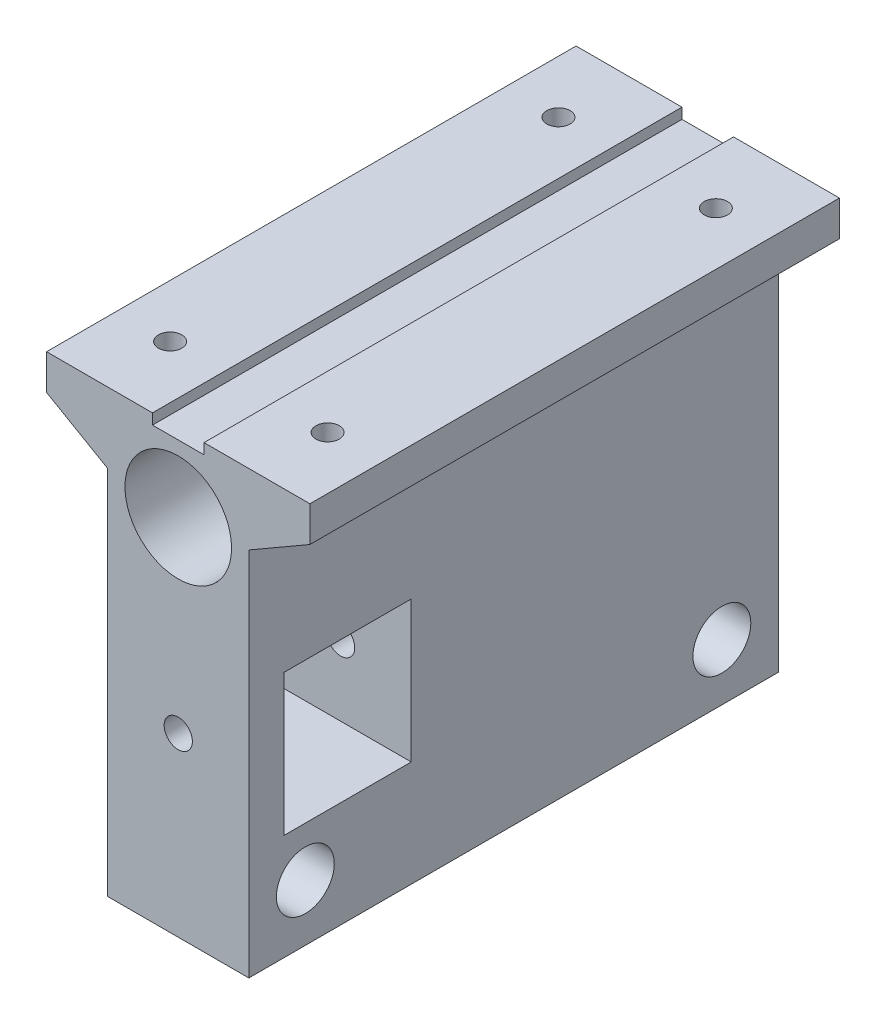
ISO-10303-21;
HEADER;
FILE_DESCRIPTION(('STEP AP214'),'2;1');
FILE_NAME('part.step','',(''),(''),'','','');
FILE_SCHEMA(('AUTOMOTIVE_DESIGN { 1 0 10303 214 1 1 1 1 }'));
ENDSEC;
DATA;
#1=APPLICATION_CONTEXT('core data for automotive mechanical design processes');
#2=APPLICATION_PROTOCOL_DEFINITION('international standard','automotive_design',2000,#1);
#3=PRODUCT_CONTEXT('',#1,'mechanical');
#4=PRODUCT('Part','Part','',(#3));
#5=PRODUCT_RELATED_PRODUCT_CATEGORY('part','',(#4));
#6=PRODUCT_DEFINITION_FORMATION('','',#4);
#7=PRODUCT_DEFINITION_CONTEXT('part definition',#1,'design');
#8=PRODUCT_DEFINITION('design','',#6,#7);
#9=PRODUCT_DEFINITION_SHAPE('','',#8);
#10=(LENGTH_UNIT() NAMED_UNIT(*) SI_UNIT(.MILLI.,.METRE.));
#11=(NAMED_UNIT(*) PLANE_ANGLE_UNIT() SI_UNIT($,.RADIAN.));
#12=(NAMED_UNIT(*) SI_UNIT($,.STERADIAN.) SOLID_ANGLE_UNIT());
#13=UNCERTAINTY_MEASURE_WITH_UNIT(LENGTH_MEASURE(1.E-05),#10,'distance_accuracy_value','');
#14=(GEOMETRIC_REPRESENTATION_CONTEXT(3) GLOBAL_UNCERTAINTY_ASSIGNED_CONTEXT((#13)) GLOBAL_UNIT_ASSIGNED_CONTEXT((#10,
#11,#12)) REPRESENTATION_CONTEXT('',''));
#15=CARTESIAN_POINT('',(0.,0.,0.));
#16=DIRECTION('',(0.,0.,1.));
#17=DIRECTION('',(1.,0.,0.));
#18=AXIS2_PLACEMENT_3D('',#15,#16,#17);
#19=CARTESIAN_POINT('',(-10.,1.00592017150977,75.));
#20=DIRECTION('',(1.,0.,0.));
#21=DIRECTION('',(0.,1.,0.));
#22=AXIS2_PLACEMENT_3D('',#19,#20,#21);
#23=PLANE('',#22);
#24=DIRECTION('',(0.,-1.,0.));
#25=VECTOR('',#24,1.);
#26=CARTESIAN_POINT('',(-10.,1.00592017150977,0.));
#27=LINE('',#26,#25);
#28=CARTESIAN_POINT('',(-10.,1.00592017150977,0.));
#29=VERTEX_POINT('',#28);
#30=CARTESIAN_POINT('',(-10.,-51.5,0.));
#31=VERTEX_POINT('',#30);
#32=EDGE_CURVE('E247',#29,#31,#27,.T.);
#33=ORIENTED_EDGE('',*,*,#32,.T.);
#34=DIRECTION('',(0.,0.,-1.));
#35=VECTOR('',#34,1.);
#36=CARTESIAN_POINT('',(-10.,-51.5,75.));
#37=LINE('',#36,#35);
#38=CARTESIAN_POINT('',(-10.,-51.5,75.));
#39=VERTEX_POINT('',#38);
#40=EDGE_CURVE('E287',#39,#31,#37,.T.);
#41=ORIENTED_EDGE('',*,*,#40,.F.);
#42=DIRECTION('',(0.,-1.,0.));
#43=VECTOR('',#42,1.);
#44=CARTESIAN_POINT('',(-10.,1.00592017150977,75.));
#45=LINE('',#44,#43);
#46=CARTESIAN_POINT('',(-10.,1.00592017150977,75.));
#47=VERTEX_POINT('',#46);
#48=EDGE_CURVE('E222',#47,#39,#45,.T.);
#49=ORIENTED_EDGE('',*,*,#48,.F.);
#50=DIRECTION('',(0.,0.,-1.));
#51=VECTOR('',#50,1.);
#52=CARTESIAN_POINT('',(-10.,1.00592017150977,75.));
#53=LINE('',#52,#51);
#54=EDGE_CURVE('E290',#47,#29,#53,.T.);
#55=ORIENTED_EDGE('',*,*,#54,.T.);
#56=EDGE_LOOP('',(#33,#41,#49,#55));
#57=FACE_BOUND('',#56,.T.);
#58=DIRECTION('',(0.,0.,-1.));
#59=VECTOR('',#58,1.);
#60=CARTESIAN_POINT('',(-10.,-16.5,75.));
#61=LINE('',#60,#59);
#62=CARTESIAN_POINT('',(-10.,-16.5,70.));
#63=VERTEX_POINT('',#62);
#64=CARTESIAN_POINT('',(-10.,-16.5,52.));
#65=VERTEX_POINT('',#64);
#66=EDGE_CURVE('E157',#63,#65,#61,.T.);
#67=ORIENTED_EDGE('',*,*,#66,.F.);
#68=DIRECTION('',(0.,-1.,0.));
#69=VECTOR('',#68,1.);
#70=CARTESIAN_POINT('',(-10.,1.00592017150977,70.));
#71=LINE('',#70,#69);
#72=CARTESIAN_POINT('',(-10.,-36.5,70.));
#73=VERTEX_POINT('',#72);
#74=EDGE_CURVE('E160',#63,#73,#71,.T.);
#75=ORIENTED_EDGE('',*,*,#74,.T.);
#76=DIRECTION('',(0.,0.,-1.));
#77=VECTOR('',#76,1.);
#78=CARTESIAN_POINT('',(-10.,-36.5,75.));
#79=LINE('',#78,#77);
#80=CARTESIAN_POINT('',(-10.,-36.5,52.));
#81=VERTEX_POINT('',#80);
#82=EDGE_CURVE('E189',#73,#81,#79,.T.);
#83=ORIENTED_EDGE('',*,*,#82,.T.);
#84=DIRECTION('',(0.,-1.,0.));
#85=VECTOR('',#84,1.);
#86=CARTESIAN_POINT('',(-10.,1.00592017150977,52.));
#87=LINE('',#86,#85);
#88=EDGE_CURVE('E192',#65,#81,#87,.T.);
#89=ORIENTED_EDGE('',*,*,#88,.F.);
#90=EDGE_LOOP('',(#67,#75,#83,#89));
#91=FACE_BOUND('',#90,.T.);
#92=ADVANCED_FACE('F40',(#57,#91),#23,.F.);
#93=CARTESIAN_POINT('',(10.,1.00592017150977,75.));
#94=DIRECTION('',(-1.,0.,0.));
#95=DIRECTION('',(0.,-1.,0.));
#96=AXIS2_PLACEMENT_3D('',#93,#94,#95);
#97=PLANE('',#96);
#98=DIRECTION('',(0.,1.,0.));
#99=VECTOR('',#98,1.);
#100=CARTESIAN_POINT('',(10.,1.00592017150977,0.));
#101=LINE('',#100,#99);
#102=CARTESIAN_POINT('',(10.,-51.5,0.));
#103=VERTEX_POINT('',#102);
#104=CARTESIAN_POINT('',(10.,1.00592017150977,0.));
#105=VERTEX_POINT('',#104);
#106=EDGE_CURVE('E251',#103,#105,#101,.T.);
#107=ORIENTED_EDGE('',*,*,#106,.T.);
#108=DIRECTION('',(0.,0.,-1.));
#109=VECTOR('',#108,1.);
#110=CARTESIAN_POINT('',(10.,1.00592017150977,75.));
#111=LINE('',#110,#109);
#112=CARTESIAN_POINT('',(10.,1.00592017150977,75.));
#113=VERTEX_POINT('',#112);
#114=EDGE_CURVE('E281',#113,#105,#111,.T.);
#115=ORIENTED_EDGE('',*,*,#114,.F.);
#116=DIRECTION('',(0.,1.,0.));
#117=VECTOR('',#116,1.);
#118=CARTESIAN_POINT('',(10.,1.00592017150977,75.));
#119=LINE('',#118,#117);
#120=CARTESIAN_POINT('',(10.,-51.5,75.));
#121=VERTEX_POINT('',#120);
#122=EDGE_CURVE('E226',#121,#113,#119,.T.);
#123=ORIENTED_EDGE('',*,*,#122,.F.);
#124=DIRECTION('',(0.,0.,-1.));
#125=VECTOR('',#124,1.);
#126=CARTESIAN_POINT('',(10.,-51.5,75.));
#127=LINE('',#126,#125);
#128=EDGE_CURVE('E284',#121,#103,#127,.T.);
#129=ORIENTED_EDGE('',*,*,#128,.T.);
#130=EDGE_LOOP('',(#107,#115,#123,#129));
#131=FACE_BOUND('',#130,.T.);
#132=CARTESIAN_POINT('',(10.,-43.5,67.));
#133=DIRECTION('',(1.,0.,0.));
#134=DIRECTION('',(0.,1.,0.));
#135=AXIS2_PLACEMENT_3D('',#132,#133,#134);
#136=CIRCLE('',#135,4.1);
#137=CARTESIAN_POINT('',(10.,-39.4,67.));
#138=VERTEX_POINT('',#137);
#139=EDGE_CURVE('E195',#138,#138,#136,.T.);
#140=ORIENTED_EDGE('',*,*,#139,.F.);
#141=EDGE_LOOP('',(#140));
#142=FACE_BOUND('',#141,.T.);
#143=CARTESIAN_POINT('',(10.,-43.5,8.));
#144=DIRECTION('',(1.,0.,0.));
#145=DIRECTION('',(0.,1.,0.));
#146=AXIS2_PLACEMENT_3D('',#143,#144,#145);
#147=CIRCLE('',#146,4.1);
#148=CARTESIAN_POINT('',(10.,-39.4,8.));
#149=VERTEX_POINT('',#148);
#150=EDGE_CURVE('E200',#149,#149,#147,.T.);
#151=ORIENTED_EDGE('',*,*,#150,.F.);
#152=EDGE_LOOP('',(#151));
#153=FACE_BOUND('',#152,.T.);
#154=DIRECTION('',(0.,0.,-1.));
#155=VECTOR('',#154,1.);
#156=CARTESIAN_POINT('',(10.,-16.5,70.));
#157=LINE('',#156,#155);
#158=CARTESIAN_POINT('',(10.,-16.5,70.));
#159=VERTEX_POINT('',#158);
#160=CARTESIAN_POINT('',(10.,-16.5,52.));
#161=VERTEX_POINT('',#160);
#162=EDGE_CURVE('E64',#159,#161,#157,.T.);
#163=ORIENTED_EDGE('',*,*,#162,.T.);
#164=DIRECTION('',(0.,-1.,0.));
#165=VECTOR('',#164,1.);
#166=CARTESIAN_POINT('',(10.,-16.5,52.));
#167=LINE('',#166,#165);
#168=CARTESIAN_POINT('',(10.,-36.5,52.));
#169=VERTEX_POINT('',#168);
#170=EDGE_CURVE('E164',#161,#169,#167,.T.);
#171=ORIENTED_EDGE('',*,*,#170,.T.);
#172=DIRECTION('',(0.,0.,-1.));
#173=VECTOR('',#172,1.);
#174=CARTESIAN_POINT('',(10.,-36.5,70.));
#175=LINE('',#174,#173);
#176=CARTESIAN_POINT('',(10.,-36.5,70.));
#177=VERTEX_POINT('',#176);
#178=EDGE_CURVE('E170',#177,#169,#175,.T.);
#179=ORIENTED_EDGE('',*,*,#178,.F.);
#180=DIRECTION('',(0.,-1.,0.));
#181=VECTOR('',#180,1.);
#182=CARTESIAN_POINT('',(10.,-16.5,70.));
#183=LINE('',#182,#181);
#184=EDGE_CURVE('E174',#159,#177,#183,.T.);
#185=ORIENTED_EDGE('',*,*,#184,.F.);
#186=EDGE_LOOP('',(#163,#171,#179,#185));
#187=FACE_BOUND('',#186,.T.);
#188=ADVANCED_FACE('F173',(#131,#142,#153,#187),#97,.F.);
#189=CARTESIAN_POINT('',(0.,0.,75.));
#190=DIRECTION('',(0.,0.,1.));
#191=DIRECTION('',(1.,0.,0.));
#192=AXIS2_PLACEMENT_3D('',#189,#190,#191);
#193=PLANE('',#192);
#194=CARTESIAN_POINT('',(0.,-26.5,75.));
#195=DIRECTION('',(0.,0.,1.));
#196=DIRECTION('',(1.,0.,0.));
#197=AXIS2_PLACEMENT_3D('',#194,#195,#196);
#198=CIRCLE('',#197,2.);
#199=CARTESIAN_POINT('',(2.,-26.5,75.));
#200=VERTEX_POINT('',#199);
#201=EDGE_CURVE('E407',#200,#200,#198,.T.);
#202=ORIENTED_EDGE('',*,*,#201,.F.);
#203=EDGE_LOOP('',(#202));
#204=FACE_BOUND('',#203,.T.);
#205=DIRECTION('',(-1.,0.,0.));
#206=VECTOR('',#205,1.);
#207=CARTESIAN_POINT('',(-3.65,11.,75.));
#208=LINE('',#207,#206);
#209=CARTESIAN_POINT('',(-3.65,11.,75.));
#210=VERTEX_POINT('',#209);
#211=CARTESIAN_POINT('',(-18.65,11.,75.));
#212=VERTEX_POINT('',#211);
#213=EDGE_CURVE('E214',#210,#212,#208,.T.);
#214=ORIENTED_EDGE('',*,*,#213,.T.);
#215=DIRECTION('',(0.,-1.,0.));
#216=VECTOR('',#215,1.);
#217=CARTESIAN_POINT('',(-18.65,11.,75.));
#218=LINE('',#217,#216);
#219=CARTESIAN_POINT('',(-18.65,6.,75.));
#220=VERTEX_POINT('',#219);
#221=EDGE_CURVE('E217',#212,#220,#218,.T.);
#222=ORIENTED_EDGE('',*,*,#221,.T.);
#223=DIRECTION('',(0.86602540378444,-0.499999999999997,0.));
#224=VECTOR('',#223,1.);
#225=CARTESIAN_POINT('',(-18.65,6.,75.));
#226=LINE('',#225,#224);
#227=EDGE_CURVE('E220',#220,#47,#226,.T.);
#228=ORIENTED_EDGE('',*,*,#227,.T.);
#229=ORIENTED_EDGE('',*,*,#48,.T.);
#230=DIRECTION('',(1.,0.,0.));
#231=VECTOR('',#230,1.);
#232=CARTESIAN_POINT('',(-10.,-51.5,75.));
#233=LINE('',#232,#231);
#234=EDGE_CURVE('E224',#39,#121,#233,.T.);
#235=ORIENTED_EDGE('',*,*,#234,.T.);
#236=ORIENTED_EDGE('',*,*,#122,.T.);
#237=DIRECTION('',(0.86602540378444,0.499999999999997,0.));
#238=VECTOR('',#237,1.);
#239=CARTESIAN_POINT('',(18.65,5.99999999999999,75.));
#240=LINE('',#239,#238);
#241=CARTESIAN_POINT('',(18.65,5.99999999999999,75.));
#242=VERTEX_POINT('',#241);
#243=EDGE_CURVE('E228',#113,#242,#240,.T.);
#244=ORIENTED_EDGE('',*,*,#243,.T.);
#245=DIRECTION('',(0.,1.,0.));
#246=VECTOR('',#245,1.);
#247=CARTESIAN_POINT('',(18.65,11.,75.));
#248=LINE('',#247,#246);
#249=CARTESIAN_POINT('',(18.65,11.,75.));
#250=VERTEX_POINT('',#249);
#251=EDGE_CURVE('E230',#242,#250,#248,.T.);
#252=ORIENTED_EDGE('',*,*,#251,.T.);
#253=DIRECTION('',(-1.,0.,0.));
#254=VECTOR('',#253,1.);
#255=CARTESIAN_POINT('',(3.65,11.,75.));
#256=LINE('',#255,#254);
#257=CARTESIAN_POINT('',(3.65,11.,75.));
#258=VERTEX_POINT('',#257);
#259=EDGE_CURVE('E232',#250,#258,#256,.T.);
#260=ORIENTED_EDGE('',*,*,#259,.T.);
#261=DIRECTION('',(0.,-1.,0.));
#262=VECTOR('',#261,1.);
#263=CARTESIAN_POINT('',(3.65,9.5,75.));
#264=LINE('',#263,#262);
#265=CARTESIAN_POINT('',(3.65,9.5,75.));
#266=VERTEX_POINT('',#265);
#267=EDGE_CURVE('E234',#258,#266,#264,.T.);
#268=ORIENTED_EDGE('',*,*,#267,.T.);
#269=DIRECTION('',(-1.,0.,0.));
#270=VECTOR('',#269,1.);
#271=CARTESIAN_POINT('',(-3.65,9.5,75.));
#272=LINE('',#271,#270);
#273=CARTESIAN_POINT('',(-3.65,9.5,75.));
#274=VERTEX_POINT('',#273);
#275=EDGE_CURVE('E236',#266,#274,#272,.T.);
#276=ORIENTED_EDGE('',*,*,#275,.T.);
#277=DIRECTION('',(0.,1.,0.));
#278=VECTOR('',#277,1.);
#279=CARTESIAN_POINT('',(-3.65,11.,75.));
#280=LINE('',#279,#278);
#281=EDGE_CURVE('E238',#274,#210,#280,.T.);
#282=ORIENTED_EDGE('',*,*,#281,.T.);
#283=EDGE_LOOP('',(#214,#222,#228,#229,#235,#236,#244,#252,#260,#268,#276,#282));
#284=FACE_BOUND('',#283,.T.);
#285=CARTESIAN_POINT('',(0.,0.,75.));
#286=DIRECTION('',(0.,0.,1.));
#287=DIRECTION('',(1.,0.,0.));
#288=AXIS2_PLACEMENT_3D('',#285,#286,#287);
#289=CIRCLE('',#288,7.55);
#290=CARTESIAN_POINT('',(7.55,0.,75.));
#291=VERTEX_POINT('',#290);
#292=EDGE_CURVE('E208',#291,#291,#289,.T.);
#293=ORIENTED_EDGE('',*,*,#292,.F.);
#294=EDGE_LOOP('',(#293));
#295=FACE_BOUND('',#294,.T.);
#296=ADVANCED_FACE('F318',(#204,#284,#295),#193,.T.);
#297=CARTESIAN_POINT('',(0.,0.,0.));
#298=DIRECTION('',(0.,0.,1.));
#299=DIRECTION('',(1.,0.,0.));
#300=AXIS2_PLACEMENT_3D('',#297,#298,#299);
#301=PLANE('',#300);
#302=DIRECTION('',(-1.,0.,0.));
#303=VECTOR('',#302,1.);
#304=CARTESIAN_POINT('',(-3.65,11.,0.));
#305=LINE('',#304,#303);
#306=CARTESIAN_POINT('',(-3.65,11.,0.));
#307=VERTEX_POINT('',#306);
#308=CARTESIAN_POINT('',(-18.65,11.,0.));
#309=VERTEX_POINT('',#308);
#310=EDGE_CURVE('E211',#307,#309,#305,.T.);
#311=ORIENTED_EDGE('',*,*,#310,.F.);
#312=DIRECTION('',(0.,1.,0.));
#313=VECTOR('',#312,1.);
#314=CARTESIAN_POINT('',(-3.65,11.,0.));
#315=LINE('',#314,#313);
#316=CARTESIAN_POINT('',(-3.65,9.5,0.));
#317=VERTEX_POINT('',#316);
#318=EDGE_CURVE('E218',#317,#307,#315,.T.);
#319=ORIENTED_EDGE('',*,*,#318,.F.);
#320=DIRECTION('',(-1.,0.,0.));
#321=VECTOR('',#320,1.);
#322=CARTESIAN_POINT('',(-3.65,9.5,0.));
#323=LINE('',#322,#321);
#324=CARTESIAN_POINT('',(3.65,9.5,0.));
#325=VERTEX_POINT('',#324);
#326=EDGE_CURVE('E261',#325,#317,#323,.T.);
#327=ORIENTED_EDGE('',*,*,#326,.F.);
#328=DIRECTION('',(0.,-1.,0.));
#329=VECTOR('',#328,1.);
#330=CARTESIAN_POINT('',(3.65,9.5,0.));
#331=LINE('',#330,#329);
#332=CARTESIAN_POINT('',(3.65,11.,0.));
#333=VERTEX_POINT('',#332);
#334=EDGE_CURVE('E259',#333,#325,#331,.T.);
#335=ORIENTED_EDGE('',*,*,#334,.F.);
#336=DIRECTION('',(-1.,0.,0.));
#337=VECTOR('',#336,1.);
#338=CARTESIAN_POINT('',(3.65,11.,0.));
#339=LINE('',#338,#337);
#340=CARTESIAN_POINT('',(18.65,11.,0.));
#341=VERTEX_POINT('',#340);
#342=EDGE_CURVE('E257',#341,#333,#339,.T.);
#343=ORIENTED_EDGE('',*,*,#342,.F.);
#344=DIRECTION('',(0.,1.,0.));
#345=VECTOR('',#344,1.);
#346=CARTESIAN_POINT('',(18.65,11.,0.));
#347=LINE('',#346,#345);
#348=CARTESIAN_POINT('',(18.65,5.99999999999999,0.));
#349=VERTEX_POINT('',#348);
#350=EDGE_CURVE('E255',#349,#341,#347,.T.);
#351=ORIENTED_EDGE('',*,*,#350,.F.);
#352=DIRECTION('',(0.86602540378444,0.499999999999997,0.));
#353=VECTOR('',#352,1.);
#354=CARTESIAN_POINT('',(18.65,5.99999999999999,0.));
#355=LINE('',#354,#353);
#356=EDGE_CURVE('E253',#105,#349,#355,.T.);
#357=ORIENTED_EDGE('',*,*,#356,.F.);
#358=ORIENTED_EDGE('',*,*,#106,.F.);
#359=DIRECTION('',(1.,0.,0.));
#360=VECTOR('',#359,1.);
#361=CARTESIAN_POINT('',(-10.,-51.5,0.));
#362=LINE('',#361,#360);
#363=EDGE_CURVE('E249',#31,#103,#362,.T.);
#364=ORIENTED_EDGE('',*,*,#363,.F.);
#365=ORIENTED_EDGE('',*,*,#32,.F.);
#366=DIRECTION('',(0.86602540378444,-0.499999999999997,0.));
#367=VECTOR('',#366,1.);
#368=CARTESIAN_POINT('',(-18.65,6.,0.));
#369=LINE('',#368,#367);
#370=CARTESIAN_POINT('',(-18.65,6.,0.));
#371=VERTEX_POINT('',#370);
#372=EDGE_CURVE('E245',#371,#29,#369,.T.);
#373=ORIENTED_EDGE('',*,*,#372,.F.);
#374=DIRECTION('',(0.,-1.,0.));
#375=VECTOR('',#374,1.);
#376=CARTESIAN_POINT('',(-18.65,11.,0.));
#377=LINE('',#376,#375);
#378=EDGE_CURVE('E243',#309,#371,#377,.T.);
#379=ORIENTED_EDGE('',*,*,#378,.F.);
#380=EDGE_LOOP('',(#311,#319,#327,#335,#343,#351,#357,#358,#364,#365,#373,#379));
#381=FACE_BOUND('',#380,.T.);
#382=CARTESIAN_POINT('',(0.,0.,0.));
#383=DIRECTION('',(0.,0.,1.));
#384=DIRECTION('',(1.,0.,0.));
#385=AXIS2_PLACEMENT_3D('',#382,#383,#384);
#386=CIRCLE('',#385,7.55);
#387=CARTESIAN_POINT('',(7.55,0.,0.));
#388=VERTEX_POINT('',#387);
#389=EDGE_CURVE('E199',#388,#388,#386,.T.);
#390=ORIENTED_EDGE('',*,*,#389,.T.);
#391=EDGE_LOOP('',(#390));
#392=FACE_BOUND('',#391,.T.);
#393=ADVANCED_FACE('F304',(#381,#392),#301,.F.);
#394=CARTESIAN_POINT('',(-3.65,11.,75.));
#395=DIRECTION('',(0.,-1.,0.));
#396=DIRECTION('',(1.,0.,0.));
#397=AXIS2_PLACEMENT_3D('',#394,#395,#396);
#398=PLANE('',#397);
#399=CARTESIAN_POINT('',(-11.15,11.,65.));
#400=DIRECTION('',(0.,1.,0.));
#401=DIRECTION('',(-1.,0.,0.));
#402=AXIS2_PLACEMENT_3D('',#399,#400,#401);
#403=CIRCLE('',#402,1.65);
#404=CARTESIAN_POINT('',(-12.8,11.,65.));
#405=VERTEX_POINT('',#404);
#406=EDGE_CURVE('E398',#405,#405,#403,.T.);
#407=ORIENTED_EDGE('',*,*,#406,.F.);
#408=EDGE_LOOP('',(#407));
#409=FACE_BOUND('',#408,.T.);
#410=CARTESIAN_POINT('',(-11.15,11.,10.));
#411=DIRECTION('',(0.,1.,0.));
#412=DIRECTION('',(-1.,0.,0.));
#413=AXIS2_PLACEMENT_3D('',#410,#411,#412);
#414=CIRCLE('',#413,1.65);
#415=CARTESIAN_POINT('',(-12.8,11.,10.));
#416=VERTEX_POINT('',#415);
#417=EDGE_CURVE('E401',#416,#416,#414,.T.);
#418=ORIENTED_EDGE('',*,*,#417,.F.);
#419=EDGE_LOOP('',(#418));
#420=FACE_BOUND('',#419,.T.);
#421=ORIENTED_EDGE('',*,*,#310,.T.);
#422=DIRECTION('',(0.,0.,-1.));
#423=VECTOR('',#422,1.);
#424=CARTESIAN_POINT('',(-18.65,11.,75.));
#425=LINE('',#424,#423);
#426=EDGE_CURVE('E13',#212,#309,#425,.T.);
#427=ORIENTED_EDGE('',*,*,#426,.F.);
#428=ORIENTED_EDGE('',*,*,#213,.F.);
#429=DIRECTION('',(0.,0.,-1.));
#430=VECTOR('',#429,1.);
#431=CARTESIAN_POINT('',(-3.65,11.,75.));
#432=LINE('',#431,#430);
#433=EDGE_CURVE('E240',#210,#307,#432,.T.);
#434=ORIENTED_EDGE('',*,*,#433,.T.);
#435=EDGE_LOOP('',(#421,#427,#428,#434));
#436=FACE_BOUND('',#435,.T.);
#437=ADVANCED_FACE('F42',(#409,#420,#436),#398,.F.);
#438=CARTESIAN_POINT('',(-18.65,11.,75.));
#439=DIRECTION('',(1.,0.,0.));
#440=DIRECTION('',(0.,0.,-1.));
#441=AXIS2_PLACEMENT_3D('',#438,#439,#440);
#442=PLANE('',#441);
#443=ORIENTED_EDGE('',*,*,#378,.T.);
#444=DIRECTION('',(0.,0.,-1.));
#445=VECTOR('',#444,1.);
#446=CARTESIAN_POINT('',(-18.65,6.,75.));
#447=LINE('',#446,#445);
#448=EDGE_CURVE('E49',#220,#371,#447,.T.);
#449=ORIENTED_EDGE('',*,*,#448,.F.);
#450=ORIENTED_EDGE('',*,*,#221,.F.);
#451=ORIENTED_EDGE('',*,*,#426,.T.);
#452=EDGE_LOOP('',(#443,#449,#450,#451));
#453=FACE_BOUND('',#452,.T.);
#454=ADVANCED_FACE('F323',(#453),#442,.F.);
#455=CARTESIAN_POINT('',(-18.65,6.,75.));
#456=DIRECTION('',(0.499999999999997,0.86602540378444,0.));
#457=DIRECTION('',(-0.86602540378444,0.499999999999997,0.));
#458=AXIS2_PLACEMENT_3D('',#455,#456,#457);
#459=PLANE('',#458);
#460=ORIENTED_EDGE('',*,*,#372,.T.);
#461=ORIENTED_EDGE('',*,*,#54,.F.);
#462=ORIENTED_EDGE('',*,*,#227,.F.);
#463=ORIENTED_EDGE('',*,*,#448,.T.);
#464=EDGE_LOOP('',(#460,#461,#462,#463));
#465=FACE_BOUND('',#464,.T.);
#466=ADVANCED_FACE('F298',(#465),#459,.F.);
#467=CARTESIAN_POINT('',(-10.,-51.5,75.));
#468=DIRECTION('',(0.,1.,0.));
#469=DIRECTION('',(0.,0.,1.));
#470=AXIS2_PLACEMENT_3D('',#467,#468,#469);
#471=PLANE('',#470);
#472=ORIENTED_EDGE('',*,*,#363,.T.);
#473=ORIENTED_EDGE('',*,*,#128,.F.);
#474=ORIENTED_EDGE('',*,*,#234,.F.);
#475=ORIENTED_EDGE('',*,*,#40,.T.);
#476=EDGE_LOOP('',(#472,#473,#474,#475));
#477=FACE_BOUND('',#476,.T.);
#478=ADVANCED_FACE('F314',(#477),#471,.F.);
#479=CARTESIAN_POINT('',(18.65,5.99999999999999,75.));
#480=DIRECTION('',(-0.499999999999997,0.86602540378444,0.));
#481=DIRECTION('',(-0.86602540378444,-0.499999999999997,0.));
#482=AXIS2_PLACEMENT_3D('',#479,#480,#481);
#483=PLANE('',#482);
#484=ORIENTED_EDGE('',*,*,#356,.T.);
#485=DIRECTION('',(0.,0.,-1.));
#486=VECTOR('',#485,1.);
#487=CARTESIAN_POINT('',(18.65,5.99999999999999,75.));
#488=LINE('',#487,#486);
#489=EDGE_CURVE('E278',#242,#349,#488,.T.);
#490=ORIENTED_EDGE('',*,*,#489,.F.);
#491=ORIENTED_EDGE('',*,*,#243,.F.);
#492=ORIENTED_EDGE('',*,*,#114,.T.);
#493=EDGE_LOOP('',(#484,#490,#491,#492));
#494=FACE_BOUND('',#493,.T.);
#495=ADVANCED_FACE('F354',(#494),#483,.F.);
#496=CARTESIAN_POINT('',(18.65,11.,75.));
#497=DIRECTION('',(-1.,0.,0.));
#498=DIRECTION('',(0.,0.,1.));
#499=AXIS2_PLACEMENT_3D('',#496,#497,#498);
#500=PLANE('',#499);
#501=ORIENTED_EDGE('',*,*,#350,.T.);
#502=DIRECTION('',(0.,0.,-1.));
#503=VECTOR('',#502,1.);
#504=CARTESIAN_POINT('',(18.65,11.,75.));
#505=LINE('',#504,#503);
#506=EDGE_CURVE('E275',#250,#341,#505,.T.);
#507=ORIENTED_EDGE('',*,*,#506,.F.);
#508=ORIENTED_EDGE('',*,*,#251,.F.);
#509=ORIENTED_EDGE('',*,*,#489,.T.);
#510=EDGE_LOOP('',(#501,#507,#508,#509));
#511=FACE_BOUND('',#510,.T.);
#512=ADVANCED_FACE('F350',(#511),#500,.F.);
#513=CARTESIAN_POINT('',(3.65,11.,75.));
#514=DIRECTION('',(0.,-1.,0.));
#515=DIRECTION('',(1.,0.,0.));
#516=AXIS2_PLACEMENT_3D('',#513,#514,#515);
#517=PLANE('',#516);
#518=CARTESIAN_POINT('',(11.15,11.,10.));
#519=DIRECTION('',(0.,1.,0.));
#520=DIRECTION('',(-1.,0.,0.));
#521=AXIS2_PLACEMENT_3D('',#518,#519,#520);
#522=CIRCLE('',#521,1.65);
#523=CARTESIAN_POINT('',(9.5,11.,10.));
#524=VERTEX_POINT('',#523);
#525=EDGE_CURVE('E404',#524,#524,#522,.T.);
#526=ORIENTED_EDGE('',*,*,#525,.F.);
#527=EDGE_LOOP('',(#526));
#528=FACE_BOUND('',#527,.T.);
#529=CARTESIAN_POINT('',(11.15,11.,65.));
#530=DIRECTION('',(0.,1.,0.));
#531=DIRECTION('',(-1.,0.,0.));
#532=AXIS2_PLACEMENT_3D('',#529,#530,#531);
#533=CIRCLE('',#532,1.65);
#534=CARTESIAN_POINT('',(9.50000000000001,11.,65.));
#535=VERTEX_POINT('',#534);
#536=EDGE_CURVE('E775',#535,#535,#533,.T.);
#537=ORIENTED_EDGE('',*,*,#536,.F.);
#538=EDGE_LOOP('',(#537));
#539=FACE_BOUND('',#538,.T.);
#540=ORIENTED_EDGE('',*,*,#342,.T.);
#541=DIRECTION('',(0.,0.,-1.));
#542=VECTOR('',#541,1.);
#543=CARTESIAN_POINT('',(3.65,11.,75.));
#544=LINE('',#543,#542);
#545=EDGE_CURVE('E272',#258,#333,#544,.T.);
#546=ORIENTED_EDGE('',*,*,#545,.F.);
#547=ORIENTED_EDGE('',*,*,#259,.F.);
#548=ORIENTED_EDGE('',*,*,#506,.T.);
#549=EDGE_LOOP('',(#540,#546,#547,#548));
#550=FACE_BOUND('',#549,.T.);
#551=ADVANCED_FACE('F345',(#528,#539,#550),#517,.F.);
#552=CARTESIAN_POINT('',(3.65,9.5,75.));
#553=DIRECTION('',(1.,0.,0.));
#554=DIRECTION('',(0.,1.,0.));
#555=AXIS2_PLACEMENT_3D('',#552,#553,#554);
#556=PLANE('',#555);
#557=ORIENTED_EDGE('',*,*,#334,.T.);
#558=DIRECTION('',(0.,0.,-1.));
#559=VECTOR('',#558,1.);
#560=CARTESIAN_POINT('',(3.65,9.5,75.));
#561=LINE('',#560,#559);
#562=EDGE_CURVE('E269',#266,#325,#561,.T.);
#563=ORIENTED_EDGE('',*,*,#562,.F.);
#564=ORIENTED_EDGE('',*,*,#267,.F.);
#565=ORIENTED_EDGE('',*,*,#545,.T.);
#566=EDGE_LOOP('',(#557,#563,#564,#565));
#567=FACE_BOUND('',#566,.T.);
#568=ADVANCED_FACE('F339',(#567),#556,.F.);
#569=CARTESIAN_POINT('',(-3.65,9.5,75.));
#570=DIRECTION('',(0.,-1.,0.));
#571=DIRECTION('',(1.,0.,0.));
#572=AXIS2_PLACEMENT_3D('',#569,#570,#571);
#573=PLANE('',#572);
#574=ORIENTED_EDGE('',*,*,#326,.T.);
#575=DIRECTION('',(0.,0.,-1.));
#576=VECTOR('',#575,1.);
#577=CARTESIAN_POINT('',(-3.65,9.5,75.));
#578=LINE('',#577,#576);
#579=EDGE_CURVE('E266',#274,#317,#578,.T.);
#580=ORIENTED_EDGE('',*,*,#579,.F.);
#581=ORIENTED_EDGE('',*,*,#275,.F.);
#582=ORIENTED_EDGE('',*,*,#562,.T.);
#583=EDGE_LOOP('',(#574,#580,#581,#582));
#584=FACE_BOUND('',#583,.T.);
#585=ADVANCED_FACE('F335',(#584),#573,.F.);
#586=CARTESIAN_POINT('',(-3.65,11.,75.));
#587=DIRECTION('',(-1.,0.,0.));
#588=DIRECTION('',(0.,-1.,0.));
#589=AXIS2_PLACEMENT_3D('',#586,#587,#588);
#590=PLANE('',#589);
#591=ORIENTED_EDGE('',*,*,#318,.T.);
#592=ORIENTED_EDGE('',*,*,#433,.F.);
#593=ORIENTED_EDGE('',*,*,#281,.F.);
#594=ORIENTED_EDGE('',*,*,#579,.T.);
#595=EDGE_LOOP('',(#591,#592,#593,#594));
#596=FACE_BOUND('',#595,.T.);
#597=ADVANCED_FACE('F330',(#596),#590,.F.);
#598=CARTESIAN_POINT('',(0.,0.,75.));
#599=DIRECTION('',(0.,0.,-1.));
#600=DIRECTION('',(-1.,0.,0.));
#601=AXIS2_PLACEMENT_3D('',#598,#599,#600);
#602=CYLINDRICAL_SURFACE('',#601,7.55);
#603=ORIENTED_EDGE('',*,*,#292,.T.);
#604=EDGE_LOOP('',(#603));
#605=FACE_BOUND('',#604,.T.);
#606=ORIENTED_EDGE('',*,*,#389,.F.);
#607=EDGE_LOOP('',(#606));
#608=FACE_BOUND('',#607,.T.);
#609=ADVANCED_FACE('F656',(#605,#608),#602,.F.);
#610=CARTESIAN_POINT('',(0.,-43.5,67.));
#611=DIRECTION('',(1.,0.,0.));
#612=DIRECTION('',(0.,1.,0.));
#613=AXIS2_PLACEMENT_3D('',#610,#611,#612);
#614=CYLINDRICAL_SURFACE('',#613,4.1);
#615=CARTESIAN_POINT('',(0.,-43.5,67.));
#616=DIRECTION('',(1.,0.,0.));
#617=DIRECTION('',(0.,1.,0.));
#618=AXIS2_PLACEMENT_3D('',#615,#616,#617);
#619=CIRCLE('',#618,4.1);
#620=CARTESIAN_POINT('',(0.,-39.4,67.));
#621=VERTEX_POINT('',#620);
#622=EDGE_CURVE('E203',#621,#621,#619,.T.);
#623=ORIENTED_EDGE('',*,*,#622,.F.);
#624=EDGE_LOOP('',(#623));
#625=FACE_BOUND('',#624,.T.);
#626=ORIENTED_EDGE('',*,*,#139,.T.);
#627=EDGE_LOOP('',(#626));
#628=FACE_BOUND('',#627,.T.);
#629=ADVANCED_FACE('F375',(#625,#628),#614,.F.);
#630=CARTESIAN_POINT('',(0.,0.,0.));
#631=DIRECTION('',(1.,0.,0.));
#632=DIRECTION('',(0.,1.,0.));
#633=AXIS2_PLACEMENT_3D('',#630,#631,#632);
#634=PLANE('',#633);
#635=ORIENTED_EDGE('',*,*,#622,.T.);
#636=EDGE_LOOP('',(#635));
#637=FACE_BOUND('',#636,.T.);
#638=ADVANCED_FACE('F366',(#637),#634,.T.);
#639=CARTESIAN_POINT('',(0.,-43.5,8.));
#640=DIRECTION('',(1.,0.,0.));
#641=DIRECTION('',(0.,1.,0.));
#642=AXIS2_PLACEMENT_3D('',#639,#640,#641);
#643=CYLINDRICAL_SURFACE('',#642,4.1);
#644=CARTESIAN_POINT('',(0.,-43.5,8.));
#645=DIRECTION('',(1.,0.,0.));
#646=DIRECTION('',(0.,1.,0.));
#647=AXIS2_PLACEMENT_3D('',#644,#645,#646);
#648=CIRCLE('',#647,4.1);
#649=CARTESIAN_POINT('',(0.,-39.4,8.));
#650=VERTEX_POINT('',#649);
#651=EDGE_CURVE('E196',#650,#650,#648,.T.);
#652=ORIENTED_EDGE('',*,*,#651,.F.);
#653=EDGE_LOOP('',(#652));
#654=FACE_BOUND('',#653,.T.);
#655=ORIENTED_EDGE('',*,*,#150,.T.);
#656=EDGE_LOOP('',(#655));
#657=FACE_BOUND('',#656,.T.);
#658=ADVANCED_FACE('F363',(#654,#657),#643,.F.);
#659=CARTESIAN_POINT('',(0.,0.,0.));
#660=DIRECTION('',(1.,0.,0.));
#661=DIRECTION('',(0.,1.,0.));
#662=AXIS2_PLACEMENT_3D('',#659,#660,#661);
#663=PLANE('',#662);
#664=ORIENTED_EDGE('',*,*,#651,.T.);
#665=EDGE_LOOP('',(#664));
#666=FACE_BOUND('',#665,.T.);
#667=ADVANCED_FACE('F365',(#666),#663,.T.);
#668=CARTESIAN_POINT('',(-18.65,-16.5,70.));
#669=DIRECTION('',(0.,-1.,0.));
#670=DIRECTION('',(0.,0.,-1.));
#671=AXIS2_PLACEMENT_3D('',#668,#669,#670);
#672=PLANE('',#671);
#673=ORIENTED_EDGE('',*,*,#66,.T.);
#674=DIRECTION('',(1.,0.,0.));
#675=VECTOR('',#674,1.);
#676=CARTESIAN_POINT('',(-18.65,-16.5,52.));
#677=LINE('',#676,#675);
#678=EDGE_CURVE('E153',#65,#161,#677,.T.);
#679=ORIENTED_EDGE('',*,*,#678,.T.);
#680=ORIENTED_EDGE('',*,*,#162,.F.);
#681=DIRECTION('',(1.,0.,0.));
#682=VECTOR('',#681,1.);
#683=CARTESIAN_POINT('',(-18.65,-16.5,70.));
#684=LINE('',#683,#682);
#685=EDGE_CURVE('E183',#63,#159,#684,.T.);
#686=ORIENTED_EDGE('',*,*,#685,.F.);
#687=EDGE_LOOP('',(#673,#679,#680,#686));
#688=FACE_BOUND('',#687,.T.);
#689=ADVANCED_FACE('F155',(#688),#672,.T.);
#690=CARTESIAN_POINT('',(-18.65,-16.5,52.));
#691=DIRECTION('',(0.,0.,1.));
#692=DIRECTION('',(1.,0.,0.));
#693=AXIS2_PLACEMENT_3D('',#690,#691,#692);
#694=PLANE('',#693);
#695=CARTESIAN_POINT('',(0.,-26.5,52.));
#696=DIRECTION('',(0.,0.,1.));
#697=DIRECTION('',(1.,0.,0.));
#698=AXIS2_PLACEMENT_3D('',#695,#696,#697);
#699=CIRCLE('',#698,2.);
#700=CARTESIAN_POINT('',(2.,-26.5,52.));
#701=VERTEX_POINT('',#700);
#702=EDGE_CURVE('E175',#701,#701,#699,.T.);
#703=ORIENTED_EDGE('',*,*,#702,.F.);
#704=EDGE_LOOP('',(#703));
#705=FACE_BOUND('',#704,.T.);
#706=ORIENTED_EDGE('',*,*,#88,.T.);
#707=DIRECTION('',(1.,0.,0.));
#708=VECTOR('',#707,1.);
#709=CARTESIAN_POINT('',(-18.65,-36.5,52.));
#710=LINE('',#709,#708);
#711=EDGE_CURVE('E161',#81,#169,#710,.T.);
#712=ORIENTED_EDGE('',*,*,#711,.T.);
#713=ORIENTED_EDGE('',*,*,#170,.F.);
#714=ORIENTED_EDGE('',*,*,#678,.F.);
#715=EDGE_LOOP('',(#706,#712,#713,#714));
#716=FACE_BOUND('',#715,.T.);
#717=ADVANCED_FACE('F165',(#705,#716),#694,.T.);
#718=CARTESIAN_POINT('',(-18.65,-36.5,70.));
#719=DIRECTION('',(0.,-1.,0.));
#720=DIRECTION('',(1.,0.,0.));
#721=AXIS2_PLACEMENT_3D('',#718,#719,#720);
#722=PLANE('',#721);
#723=DIRECTION('',(1.,0.,0.));
#724=VECTOR('',#723,1.);
#725=CARTESIAN_POINT('',(-18.65,-36.5,70.));
#726=LINE('',#725,#724);
#727=EDGE_CURVE('E56',#73,#177,#726,.T.);
#728=ORIENTED_EDGE('',*,*,#727,.T.);
#729=ORIENTED_EDGE('',*,*,#178,.T.);
#730=ORIENTED_EDGE('',*,*,#711,.F.);
#731=ORIENTED_EDGE('',*,*,#82,.F.);
#732=EDGE_LOOP('',(#728,#729,#730,#731));
#733=FACE_BOUND('',#732,.T.);
#734=ADVANCED_FACE('F435',(#733),#722,.F.);
#735=CARTESIAN_POINT('',(-18.65,-16.5,70.));
#736=DIRECTION('',(0.,0.,1.));
#737=DIRECTION('',(0.,-1.,0.));
#738=AXIS2_PLACEMENT_3D('',#735,#736,#737);
#739=PLANE('',#738);
#740=CARTESIAN_POINT('',(0.,-26.5,70.));
#741=DIRECTION('',(0.,0.,1.));
#742=DIRECTION('',(0.,-1.,0.));
#743=AXIS2_PLACEMENT_3D('',#740,#741,#742);
#744=CIRCLE('',#743,2.);
#745=CARTESIAN_POINT('',(0.,-28.5,70.));
#746=VERTEX_POINT('',#745);
#747=EDGE_CURVE('E44',#746,#746,#744,.T.);
#748=ORIENTED_EDGE('',*,*,#747,.T.);
#749=EDGE_LOOP('',(#748));
#750=FACE_BOUND('',#749,.T.);
#751=ORIENTED_EDGE('',*,*,#685,.T.);
#752=ORIENTED_EDGE('',*,*,#184,.T.);
#753=ORIENTED_EDGE('',*,*,#727,.F.);
#754=ORIENTED_EDGE('',*,*,#74,.F.);
#755=EDGE_LOOP('',(#751,#752,#753,#754));
#756=FACE_BOUND('',#755,.T.);
#757=ADVANCED_FACE('F422',(#750,#756),#739,.F.);
#758=CARTESIAN_POINT('',(0.,-26.5,36.3431457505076));
#759=DIRECTION('',(0.,0.,1.));
#760=DIRECTION('',(1.,0.,0.));
#761=AXIS2_PLACEMENT_3D('',#758,#759,#760);
#762=CYLINDRICAL_SURFACE('',#761,2.);
#763=ORIENTED_EDGE('',*,*,#201,.T.);
#764=EDGE_LOOP('',(#763));
#765=FACE_BOUND('',#764,.T.);
#766=ORIENTED_EDGE('',*,*,#747,.F.);
#767=EDGE_LOOP('',(#766));
#768=FACE_BOUND('',#767,.T.);
#769=ADVANCED_FACE('F424',(#765,#768),#762,.F.);
#770=ORIENTED_EDGE('',*,*,#702,.T.);
#771=EDGE_LOOP('',(#770));
#772=FACE_BOUND('',#771,.T.);
#773=CARTESIAN_POINT('',(0.,-26.5,47.));
#774=DIRECTION('',(0.,0.,1.));
#775=DIRECTION('',(1.,0.,0.));
#776=AXIS2_PLACEMENT_3D('',#773,#774,#775);
#777=CIRCLE('',#776,2.);
#778=CARTESIAN_POINT('',(2.,-26.5,47.));
#779=VERTEX_POINT('',#778);
#780=EDGE_CURVE('E415',#779,#779,#777,.F.);
#781=ORIENTED_EDGE('',*,*,#780,.T.);
#782=EDGE_LOOP('',(#781));
#783=FACE_BOUND('',#782,.T.);
#784=ADVANCED_FACE('F426',(#772,#783),#762,.F.);
#785=CARTESIAN_POINT('',(-18.65,-16.5,47.));
#786=DIRECTION('',(0.,0.,1.));
#787=DIRECTION('',(1.,0.,0.));
#788=AXIS2_PLACEMENT_3D('',#785,#786,#787);
#789=PLANE('',#788);
#790=ORIENTED_EDGE('',*,*,#780,.F.);
#791=EDGE_LOOP('',(#790));
#792=FACE_BOUND('',#791,.T.);
#793=ADVANCED_FACE('F433',(#792),#789,.T.);
#794=CARTESIAN_POINT('',(11.15,6.,65.));
#795=DIRECTION('',(0.,1.,0.));
#796=DIRECTION('',(-1.,0.,0.));
#797=AXIS2_PLACEMENT_3D('',#794,#795,#796);
#798=CYLINDRICAL_SURFACE('',#797,1.65);
#799=CARTESIAN_POINT('',(11.15,6.,65.));
#800=DIRECTION('',(0.,1.,0.));
#801=DIRECTION('',(-1.,0.,0.));
#802=AXIS2_PLACEMENT_3D('',#799,#800,#801);
#803=CIRCLE('',#802,1.65);
#804=CARTESIAN_POINT('',(9.50000000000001,6.,65.));
#805=VERTEX_POINT('',#804);
#806=EDGE_CURVE('E778',#805,#805,#803,.T.);
#807=ORIENTED_EDGE('',*,*,#806,.F.);
#808=EDGE_LOOP('',(#807));
#809=FACE_BOUND('',#808,.T.);
#810=ORIENTED_EDGE('',*,*,#536,.T.);
#811=EDGE_LOOP('',(#810));
#812=FACE_BOUND('',#811,.T.);
#813=ADVANCED_FACE('F486',(#809,#812),#798,.F.);
#814=CARTESIAN_POINT('',(11.15,6.,65.));
#815=DIRECTION('',(0.,1.,0.));
#816=DIRECTION('',(-1.,0.,0.));
#817=AXIS2_PLACEMENT_3D('',#814,#815,#816);
#818=PLANE('',#817);
#819=ORIENTED_EDGE('',*,*,#806,.T.);
#820=EDGE_LOOP('',(#819));
#821=FACE_BOUND('',#820,.T.);
#822=ADVANCED_FACE('F518',(#821),#818,.T.);
#823=CARTESIAN_POINT('',(11.15,6.,10.));
#824=DIRECTION('',(0.,1.,0.));
#825=DIRECTION('',(-1.,0.,0.));
#826=AXIS2_PLACEMENT_3D('',#823,#824,#825);
#827=CYLINDRICAL_SURFACE('',#826,1.65);
#828=CARTESIAN_POINT('',(11.15,6.,10.));
#829=DIRECTION('',(0.,1.,0.));
#830=DIRECTION('',(-1.,0.,0.));
#831=AXIS2_PLACEMENT_3D('',#828,#829,#830);
#832=CIRCLE('',#831,1.65);
#833=CARTESIAN_POINT('',(9.5,6.,10.));
#834=VERTEX_POINT('',#833);
#835=EDGE_CURVE('E410',#834,#834,#832,.T.);
#836=ORIENTED_EDGE('',*,*,#835,.F.);
#837=EDGE_LOOP('',(#836));
#838=FACE_BOUND('',#837,.T.);
#839=ORIENTED_EDGE('',*,*,#525,.T.);
#840=EDGE_LOOP('',(#839));
#841=FACE_BOUND('',#840,.T.);
#842=ADVANCED_FACE('F529',(#838,#841),#827,.F.);
#843=CARTESIAN_POINT('',(11.15,6.,10.));
#844=DIRECTION('',(0.,1.,0.));
#845=DIRECTION('',(-1.,0.,0.));
#846=AXIS2_PLACEMENT_3D('',#843,#844,#845);
#847=PLANE('',#846);
#848=ORIENTED_EDGE('',*,*,#835,.T.);
#849=EDGE_LOOP('',(#848));
#850=FACE_BOUND('',#849,.T.);
#851=ADVANCED_FACE('F540',(#850),#847,.T.);
#852=CARTESIAN_POINT('',(-11.15,6.,10.));
#853=DIRECTION('',(0.,1.,0.));
#854=DIRECTION('',(-1.,0.,0.));
#855=AXIS2_PLACEMENT_3D('',#852,#853,#854);
#856=CYLINDRICAL_SURFACE('',#855,1.65);
#857=CARTESIAN_POINT('',(-11.15,6.,10.));
#858=DIRECTION('',(0.,1.,0.));
#859=DIRECTION('',(-1.,0.,0.));
#860=AXIS2_PLACEMENT_3D('',#857,#858,#859);
#861=CIRCLE('',#860,1.65);
#862=CARTESIAN_POINT('',(-12.8,6.,10.));
#863=VERTEX_POINT('',#862);
#864=EDGE_CURVE('E403',#863,#863,#861,.T.);
#865=ORIENTED_EDGE('',*,*,#864,.F.);
#866=EDGE_LOOP('',(#865));
#867=FACE_BOUND('',#866,.T.);
#868=ORIENTED_EDGE('',*,*,#417,.T.);
#869=EDGE_LOOP('',(#868));
#870=FACE_BOUND('',#869,.T.);
#871=ADVANCED_FACE('F551',(#867,#870),#856,.F.);
#872=CARTESIAN_POINT('',(-11.15,6.,10.));
#873=DIRECTION('',(0.,1.,0.));
#874=DIRECTION('',(-1.,0.,0.));
#875=AXIS2_PLACEMENT_3D('',#872,#873,#874);
#876=PLANE('',#875);
#877=ORIENTED_EDGE('',*,*,#864,.T.);
#878=EDGE_LOOP('',(#877));
#879=FACE_BOUND('',#878,.T.);
#880=ADVANCED_FACE('F562',(#879),#876,.T.);
#881=CARTESIAN_POINT('',(-11.15,6.,65.));
#882=DIRECTION('',(0.,1.,0.));
#883=DIRECTION('',(-1.,0.,0.));
#884=AXIS2_PLACEMENT_3D('',#881,#882,#883);
#885=CYLINDRICAL_SURFACE('',#884,1.65);
#886=CARTESIAN_POINT('',(-11.15,6.,65.));
#887=DIRECTION('',(0.,1.,0.));
#888=DIRECTION('',(-1.,0.,0.));
#889=AXIS2_PLACEMENT_3D('',#886,#887,#888);
#890=CIRCLE('',#889,1.65);
#891=CARTESIAN_POINT('',(-12.8,6.,65.));
#892=VERTEX_POINT('',#891);
#893=EDGE_CURVE('E774',#892,#892,#890,.T.);
#894=ORIENTED_EDGE('',*,*,#893,.F.);
#895=EDGE_LOOP('',(#894));
#896=FACE_BOUND('',#895,.T.);
#897=ORIENTED_EDGE('',*,*,#406,.T.);
#898=EDGE_LOOP('',(#897));
#899=FACE_BOUND('',#898,.T.);
#900=ADVANCED_FACE('F572',(#896,#899),#885,.F.);
#901=CARTESIAN_POINT('',(-11.15,6.,65.));
#902=DIRECTION('',(0.,1.,0.));
#903=DIRECTION('',(-1.,0.,0.));
#904=AXIS2_PLACEMENT_3D('',#901,#902,#903);
#905=PLANE('',#904);
#906=ORIENTED_EDGE('',*,*,#893,.T.);
#907=EDGE_LOOP('',(#906));
#908=FACE_BOUND('',#907,.T.);
#909=ADVANCED_FACE('F583',(#908),#905,.T.);
#910=CLOSED_SHELL('',(#92,#188,#296,#393,#437,#454,#466,#478,#495,#512,#551,#568,#585,#597,#609,
#629,#638,#658,#667,#689,#717,#734,#757,#769,#784,#793,#813,#822,#842,#851,#871,#880,#900,#909));
#911=MANIFOLD_SOLID_BREP('B2',#910);
#912=ADVANCED_BREP_SHAPE_REPRESENTATION('',(#18,#911),#14);
#913=SHAPE_DEFINITION_REPRESENTATION(#9,#912);
ENDSEC;
END-ISO-10303-21;
